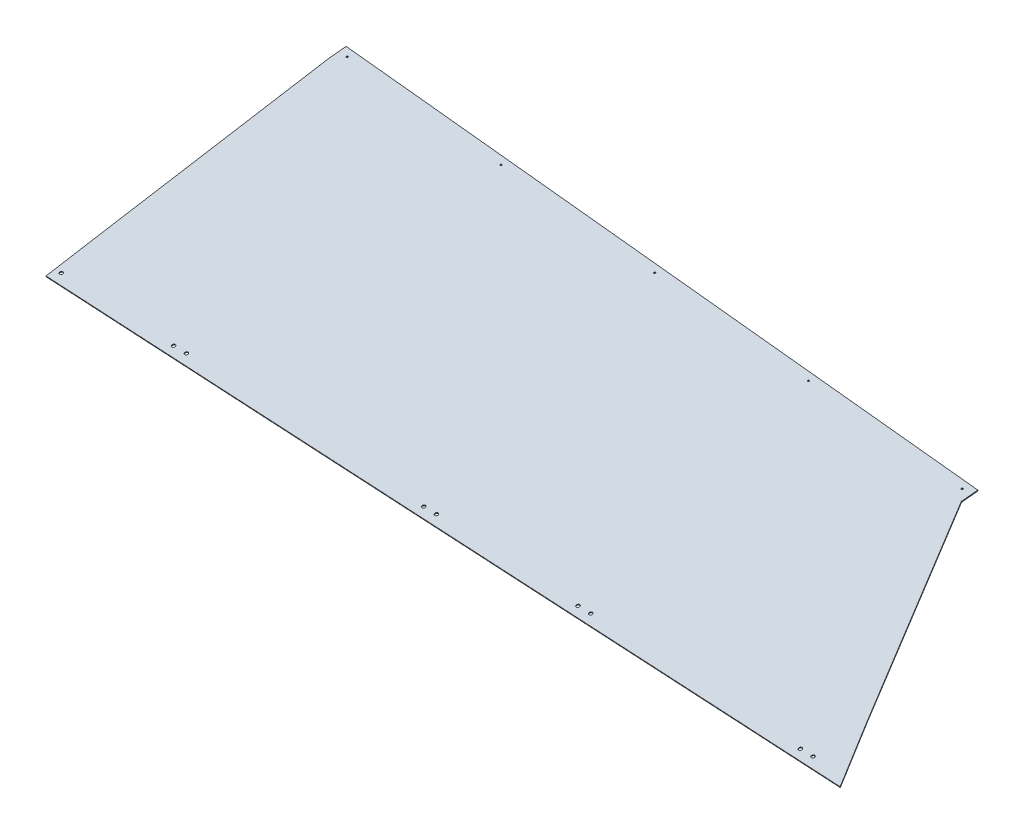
ISO-10303-21;
HEADER;
FILE_DESCRIPTION(('STEP AP214'),'2;1');
FILE_NAME('part.step','',(''),(''),'','','');
FILE_SCHEMA(('AUTOMOTIVE_DESIGN { 1 0 10303 214 1 1 1 1 }'));
ENDSEC;
DATA;
#1=APPLICATION_CONTEXT('core data for automotive mechanical design processes');
#2=APPLICATION_PROTOCOL_DEFINITION('international standard','automotive_design',2000,#1);
#3=PRODUCT_CONTEXT('',#1,'mechanical');
#4=PRODUCT('Part','Part','',(#3));
#5=PRODUCT_RELATED_PRODUCT_CATEGORY('part','',(#4));
#6=PRODUCT_DEFINITION_FORMATION('','',#4);
#7=PRODUCT_DEFINITION_CONTEXT('part definition',#1,'design');
#8=PRODUCT_DEFINITION('design','',#6,#7);
#9=PRODUCT_DEFINITION_SHAPE('','',#8);
#10=(LENGTH_UNIT() NAMED_UNIT(*) SI_UNIT(.MILLI.,.METRE.));
#11=(NAMED_UNIT(*) PLANE_ANGLE_UNIT() SI_UNIT($,.RADIAN.));
#12=(NAMED_UNIT(*) SI_UNIT($,.STERADIAN.) SOLID_ANGLE_UNIT());
#13=UNCERTAINTY_MEASURE_WITH_UNIT(LENGTH_MEASURE(1.E-05),#10,'distance_accuracy_value','');
#14=(GEOMETRIC_REPRESENTATION_CONTEXT(3) GLOBAL_UNCERTAINTY_ASSIGNED_CONTEXT((#13)) GLOBAL_UNIT_ASSIGNED_CONTEXT((#10,
#11,#12)) REPRESENTATION_CONTEXT('',''));
#15=CARTESIAN_POINT('',(0.,0.,0.));
#16=DIRECTION('',(0.,0.,1.));
#17=DIRECTION('',(1.,0.,0.));
#18=AXIS2_PLACEMENT_3D('',#15,#16,#17);
#19=CARTESIAN_POINT('',(6.04000777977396,-300.572395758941,-61.7927019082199));
#20=DIRECTION('',(-0.0196795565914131,0.979325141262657,0.201333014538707));
#21=DIRECTION('',(0.,-0.201372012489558,0.979514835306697));
#22=AXIS2_PLACEMENT_3D('',#19,#20,#21);
#23=PLANE('',#22);
#24=DIRECTION('',(0.0340234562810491,0.201911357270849,-0.978812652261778));
#25=VECTOR('',#24,1.);
#26=CARTESIAN_POINT('',(766.441701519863,-291.126569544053,-33.4126913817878));
#27=LINE('',#26,#25);
#28=CARTESIAN_POINT('',(793.777141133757,-128.905081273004,-819.819396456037));
#29=VERTEX_POINT('',#28);
#30=CARTESIAN_POINT('',(809.033287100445,-38.3678614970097,-1258.71980015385));
#31=VERTEX_POINT('',#30);
#32=EDGE_CURVE('E166',#29,#31,#27,.T.);
#33=ORIENTED_EDGE('',*,*,#32,.T.);
#34=DIRECTION('',(-0.0952713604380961,-0.202292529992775,0.974679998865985));
#35=VECTOR('',#34,1.);
#36=CARTESIAN_POINT('',(809.224725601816,-37.9613743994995,-1260.6783244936));
#37=LINE('',#36,#35);
#38=CARTESIAN_POINT('',(811.99728806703,-32.0743095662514,-1289.04320947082));
#39=VERTEX_POINT('',#38);
#40=EDGE_CURVE('E170',#39,#31,#37,.T.);
#41=ORIENTED_EDGE('',*,*,#40,.F.);
#42=DIRECTION('',(-0.995256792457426,0.,-0.0972826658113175));
#43=VECTOR('',#42,1.);
#44=CARTESIAN_POINT('',(-2549.86215064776,-32.0743095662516,-1617.65251991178));
#45=LINE('',#44,#43);
#46=CARTESIAN_POINT('',(2162.15614787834,-32.0743095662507,-1157.07018085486));
#47=VERTEX_POINT('',#46);
#48=EDGE_CURVE('E239',#47,#39,#45,.T.);
#49=ORIENTED_EDGE('',*,*,#48,.F.);
#50=DIRECTION('',(0.0952713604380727,0.202292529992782,-0.974679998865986));
#51=VECTOR('',#50,1.);
#52=CARTESIAN_POINT('',(2159.3182985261,-38.0999999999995,-1128.03737403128));
#53=LINE('',#52,#51);
#54=CARTESIAN_POINT('',(2159.3182985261,-38.0999999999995,-1128.03737403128));
#55=VERTEX_POINT('',#54);
#56=EDGE_CURVE('E191',#55,#47,#53,.T.);
#57=ORIENTED_EDGE('',*,*,#56,.F.);
#58=DIRECTION('',(0.458872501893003,-0.170063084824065,0.872074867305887));
#59=VECTOR('',#58,1.);
#60=CARTESIAN_POINT('',(2153.07848128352,-35.7874566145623,-1139.89597913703));
#61=LINE('',#60,#59);
#62=CARTESIAN_POINT('',(2362.95658734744,-113.570540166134,-741.028274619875));
#63=VERTEX_POINT('',#62);
#64=EDGE_CURVE('E176',#55,#63,#61,.T.);
#65=ORIENTED_EDGE('',*,*,#64,.T.);
#66=DIRECTION('',(-0.549500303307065,0.157636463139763,-0.820487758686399));
#67=VECTOR('',#66,1.);
#68=CARTESIAN_POINT('',(2363.38181094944,-113.692525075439,-740.393350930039));
#69=LINE('',#68,#67);
#70=CARTESIAN_POINT('',(2363.38181094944,-113.692525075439,-740.393350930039));
#71=VERTEX_POINT('',#70);
#72=EDGE_CURVE('E142',#71,#63,#69,.T.);
#73=ORIENTED_EDGE('',*,*,#72,.F.);
#74=DIRECTION('',(0.468027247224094,-0.168921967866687,0.867419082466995));
#75=VECTOR('',#74,1.);
#76=CARTESIAN_POINT('',(2157.84554695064,-39.5096855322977,-1121.32433003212));
#77=LINE('',#76,#75);
#78=CARTESIAN_POINT('',(2422.08735658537,-134.880728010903,-631.591329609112));
#79=VERTEX_POINT('',#78);
#80=EDGE_CURVE('E297',#71,#79,#77,.T.);
#81=ORIENTED_EDGE('',*,*,#80,.T.);
#82=DIRECTION('',(-0.998109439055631,-0.00751635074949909,-0.0610004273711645));
#83=VECTOR('',#82,1.);
#84=CARTESIAN_POINT('',(2449.4820662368,-134.674429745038,-629.917075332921));
#85=LINE('',#84,#83);
#86=CARTESIAN_POINT('',(790.947801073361,-147.164167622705,-731.28000711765));
#87=VERTEX_POINT('',#86);
#88=EDGE_CURVE('E304',#79,#87,#85,.T.);
#89=ORIENTED_EDGE('',*,*,#88,.T.);
#90=DIRECTION('',(0.0312390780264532,0.201875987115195,-0.978912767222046));
#91=VECTOR('',#90,1.);
#92=CARTESIAN_POINT('',(767.146224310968,-300.976863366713,14.5700257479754));
#93=LINE('',#92,#91);
#94=CARTESIAN_POINT('',(793.753728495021,-129.031450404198,-819.206999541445));
#95=VERTEX_POINT('',#94);
#96=EDGE_CURVE('E308',#87,#95,#93,.T.);
#97=ORIENTED_EDGE('',*,*,#96,.T.);
#98=DIRECTION('',(-0.0374160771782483,-0.201952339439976,0.978680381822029));
#99=VECTOR('',#98,1.);
#100=CARTESIAN_POINT('',(793.777141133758,-128.905081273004,-819.819396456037));
#101=LINE('',#100,#99);
#102=EDGE_CURVE('E175',#29,#95,#101,.T.);
#103=ORIENTED_EDGE('',*,*,#102,.F.);
#104=EDGE_LOOP('',(#33,#41,#49,#57,#65,#73,#81,#89,#97,#103));
#105=FACE_BOUND('',#104,.T.);
#106=CARTESIAN_POINT('',(827.96717309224,-34.6434246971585,-1274.98550859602));
#107=DIRECTION('',(0.0196795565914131,-0.979325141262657,-0.201333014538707));
#108=DIRECTION('',(-0.995256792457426,0.,-0.0972826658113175));
#109=AXIS2_PLACEMENT_3D('',#106,#107,#108);
#110=CIRCLE('',#109,1.58749999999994);
#111=CARTESIAN_POINT('',(826.387202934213,-34.6434246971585,-1275.139944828));
#112=VERTEX_POINT('',#111);
#113=EDGE_CURVE('E395',#112,#112,#110,.T.);
#114=ORIENTED_EDGE('',*,*,#113,.F.);
#115=EDGE_LOOP('',(#114));
#116=FACE_BOUND('',#115,.T.);
#117=CARTESIAN_POINT('',(1156.60096596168,-34.643424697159,-1242.86277234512));
#118=DIRECTION('',(0.0196795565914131,-0.979325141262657,-0.201333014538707));
#119=DIRECTION('',(-0.995256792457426,0.,-0.0972826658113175));
#120=AXIS2_PLACEMENT_3D('',#117,#118,#119);
#121=CIRCLE('',#120,1.58749999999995);
#122=CARTESIAN_POINT('',(1155.02099580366,-34.643424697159,-1243.0172085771));
#123=VERTEX_POINT('',#122);
#124=EDGE_CURVE('E398',#123,#123,#121,.T.);
#125=ORIENTED_EDGE('',*,*,#124,.F.);
#126=EDGE_LOOP('',(#125));
#127=FACE_BOUND('',#126,.T.);
#128=CARTESIAN_POINT('',(1485.23475883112,-34.6434246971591,-1210.74003609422));
#129=DIRECTION('',(0.0196795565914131,-0.979325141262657,-0.201333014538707));
#130=DIRECTION('',(-0.995256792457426,0.,-0.0972826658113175));
#131=AXIS2_PLACEMENT_3D('',#128,#129,#130);
#132=CIRCLE('',#131,1.58749999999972);
#133=CARTESIAN_POINT('',(1483.6547886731,-34.6434246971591,-1210.8944723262));
#134=VERTEX_POINT('',#133);
#135=EDGE_CURVE('E401',#134,#134,#132,.T.);
#136=ORIENTED_EDGE('',*,*,#135,.F.);
#137=EDGE_LOOP('',(#136));
#138=FACE_BOUND('',#137,.T.);
#139=CARTESIAN_POINT('',(1813.86855170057,-34.6434246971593,-1178.61729984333));
#140=DIRECTION('',(0.0196795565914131,-0.979325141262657,-0.201333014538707));
#141=DIRECTION('',(-0.995256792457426,0.,-0.0972826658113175));
#142=AXIS2_PLACEMENT_3D('',#139,#140,#141);
#143=CIRCLE('',#142,1.58749999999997);
#144=CARTESIAN_POINT('',(1812.28858154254,-34.6434246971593,-1178.7717360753));
#145=VERTEX_POINT('',#144);
#146=EDGE_CURVE('E404',#145,#145,#143,.T.);
#147=ORIENTED_EDGE('',*,*,#146,.F.);
#148=EDGE_LOOP('',(#147));
#149=FACE_BOUND('',#148,.T.);
#150=CARTESIAN_POINT('',(2142.50234457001,-34.6434246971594,-1146.49456359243));
#151=DIRECTION('',(0.0196795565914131,-0.979325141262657,-0.201333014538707));
#152=DIRECTION('',(-0.995256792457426,0.,-0.0972826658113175));
#153=AXIS2_PLACEMENT_3D('',#150,#151,#152);
#154=CIRCLE('',#153,1.58750000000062);
#155=CARTESIAN_POINT('',(2140.92237441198,-34.6434246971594,-1146.6489998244));
#156=VERTEX_POINT('',#155);
#157=EDGE_CURVE('E246',#156,#156,#154,.T.);
#158=ORIENTED_EDGE('',*,*,#157,.F.);
#159=EDGE_LOOP('',(#158));
#160=FACE_BOUND('',#159,.T.);
#161=CARTESIAN_POINT('',(804.318580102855,-143.551091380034,-747.547808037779));
#162=DIRECTION('',(0.0196795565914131,-0.979325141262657,-0.201333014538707));
#163=DIRECTION('',(-0.00344658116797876,0.201304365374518,-0.979522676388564));
#164=AXIS2_PLACEMENT_3D('',#161,#162,#163);
#165=CIRCLE('',#164,3.17500000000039);
#166=CARTESIAN_POINT('',(804.307637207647,-142.91195001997,-750.657792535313));
#167=VERTEX_POINT('',#166);
#168=EDGE_CURVE('E324',#167,#167,#165,.T.);
#169=ORIENTED_EDGE('',*,*,#168,.F.);
#170=EDGE_LOOP('',(#169));
#171=FACE_BOUND('',#170,.T.);
#172=CARTESIAN_POINT('',(1035.72668025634,-141.960151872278,-732.667179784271));
#173=DIRECTION('',(0.0196795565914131,-0.979325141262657,-0.201333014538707));
#174=DIRECTION('',(-0.00344658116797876,0.201304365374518,-0.979522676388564));
#175=AXIS2_PLACEMENT_3D('',#172,#173,#174);
#176=CIRCLE('',#175,3.17500000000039);
#177=CARTESIAN_POINT('',(1035.71573736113,-141.321010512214,-735.777164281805));
#178=VERTEX_POINT('',#177);
#179=EDGE_CURVE('E330',#178,#178,#176,.T.);
#180=ORIENTED_EDGE('',*,*,#179,.F.);
#181=EDGE_LOOP('',(#180));
#182=FACE_BOUND('',#181,.T.);
#183=CARTESIAN_POINT('',(1061.11133359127,-141.617294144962,-731.853654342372));
#184=DIRECTION('',(0.0196795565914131,-0.979325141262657,-0.201333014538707));
#185=DIRECTION('',(-0.00344658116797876,0.201304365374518,-0.979522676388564));
#186=AXIS2_PLACEMENT_3D('',#183,#184,#185);
#187=CIRCLE('',#186,3.17500000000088);
#188=CARTESIAN_POINT('',(1061.10039069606,-140.978152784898,-734.963638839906));
#189=VERTEX_POINT('',#188);
#190=EDGE_CURVE('E336',#189,#189,#187,.T.);
#191=ORIENTED_EDGE('',*,*,#190,.F.);
#192=EDGE_LOOP('',(#191));
#193=FACE_BOUND('',#192,.T.);
#194=CARTESIAN_POINT('',(1549.31218723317,-138.092557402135,-701.278872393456));
#195=DIRECTION('',(0.0196795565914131,-0.979325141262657,-0.201333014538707));
#196=DIRECTION('',(-0.00344658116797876,0.201304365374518,-0.979522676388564));
#197=AXIS2_PLACEMENT_3D('',#194,#195,#196);
#198=CIRCLE('',#197,3.17500000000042);
#199=CARTESIAN_POINT('',(1549.30124433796,-137.453416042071,-704.38885689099));
#200=VERTEX_POINT('',#199);
#201=EDGE_CURVE('E342',#200,#200,#198,.T.);
#202=ORIENTED_EDGE('',*,*,#201,.F.);
#203=EDGE_LOOP('',(#202));
#204=FACE_BOUND('',#203,.T.);
#205=CARTESIAN_POINT('',(1574.69684056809,-137.749699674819,-700.465346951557));
#206=DIRECTION('',(0.0196795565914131,-0.979325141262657,-0.201333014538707));
#207=DIRECTION('',(-0.00344658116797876,0.201304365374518,-0.979522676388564));
#208=AXIS2_PLACEMENT_3D('',#205,#206,#207);
#209=CIRCLE('',#208,3.17500000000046);
#210=CARTESIAN_POINT('',(1574.68589767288,-137.110558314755,-703.575331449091));
#211=VERTEX_POINT('',#210);
#212=EDGE_CURVE('E348',#211,#211,#209,.T.);
#213=ORIENTED_EDGE('',*,*,#212,.F.);
#214=EDGE_LOOP('',(#213));
#215=FACE_BOUND('',#214,.T.);
#216=CARTESIAN_POINT('',(1866.3402779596,-135.705153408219,-681.903374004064));
#217=DIRECTION('',(0.0196795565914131,-0.979325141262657,-0.201333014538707));
#218=DIRECTION('',(-0.00344658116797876,0.201304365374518,-0.979522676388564));
#219=AXIS2_PLACEMENT_3D('',#216,#217,#218);
#220=CIRCLE('',#219,3.17500000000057);
#221=CARTESIAN_POINT('',(1866.32933506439,-135.066012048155,-685.013358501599));
#222=VERTEX_POINT('',#221);
#223=EDGE_CURVE('E354',#222,#222,#220,.T.);
#224=ORIENTED_EDGE('',*,*,#223,.F.);
#225=EDGE_LOOP('',(#224));
#226=FACE_BOUND('',#225,.T.);
#227=CARTESIAN_POINT('',(1891.72493129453,-135.362295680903,-681.089848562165));
#228=DIRECTION('',(0.0196795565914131,-0.979325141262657,-0.201333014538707));
#229=DIRECTION('',(-0.00344658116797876,0.201304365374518,-0.979522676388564));
#230=AXIS2_PLACEMENT_3D('',#227,#228,#229);
#231=CIRCLE('',#230,3.17500000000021);
#232=CARTESIAN_POINT('',(1891.71398839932,-134.723154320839,-684.199833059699));
#233=VERTEX_POINT('',#232);
#234=EDGE_CURVE('E360',#233,#233,#231,.T.);
#235=ORIENTED_EDGE('',*,*,#234,.F.);
#236=EDGE_LOOP('',(#235));
#237=FACE_BOUND('',#236,.T.);
#238=CARTESIAN_POINT('',(2322.86072860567,-132.267291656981,-654.00265632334));
#239=DIRECTION('',(0.0196795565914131,-0.979325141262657,-0.201333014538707));
#240=DIRECTION('',(-0.00344658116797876,0.201304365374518,-0.979522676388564));
#241=AXIS2_PLACEMENT_3D('',#238,#239,#240);
#242=CIRCLE('',#241,3.1750000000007);
#243=CARTESIAN_POINT('',(2322.84978571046,-131.628150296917,-657.112640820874));
#244=VERTEX_POINT('',#243);
#245=EDGE_CURVE('E366',#244,#244,#242,.T.);
#246=ORIENTED_EDGE('',*,*,#245,.F.);
#247=EDGE_LOOP('',(#246));
#248=FACE_BOUND('',#247,.T.);
#249=CARTESIAN_POINT('',(2348.24538194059,-131.924433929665,-653.189130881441));
#250=DIRECTION('',(0.0196795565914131,-0.979325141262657,-0.201333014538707));
#251=DIRECTION('',(-0.00344658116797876,0.201304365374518,-0.979522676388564));
#252=AXIS2_PLACEMENT_3D('',#249,#250,#251);
#253=CIRCLE('',#252,3.17500000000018);
#254=CARTESIAN_POINT('',(2348.23443904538,-131.285292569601,-656.299115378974));
#255=VERTEX_POINT('',#254);
#256=EDGE_CURVE('E372',#255,#255,#253,.T.);
#257=ORIENTED_EDGE('',*,*,#256,.F.);
#258=EDGE_LOOP('',(#257));
#259=FACE_BOUND('',#258,.T.);
#260=ADVANCED_FACE('F127',(#105,#116,#127,#138,#149,#160,#171,#182,#193,#204,#215,#226,#237,
#248,#259),#23,.F.);
#261=CARTESIAN_POINT('',(2087.92964251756,3206.25183584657,-473.386444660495));
#262=DIRECTION('',(0.888284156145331,0.109548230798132,-0.446038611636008));
#263=DIRECTION('',(-0.448739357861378,0.,-0.893662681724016));
#264=AXIS2_PLACEMENT_3D('',#261,#262,#263);
#265=PLANE('',#264);
#266=ORIENTED_EDGE('',*,*,#64,.F.);
#267=DIRECTION('',(-0.0196795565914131,0.979325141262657,0.201333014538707));
#268=VECTOR('',#267,1.);
#269=CARTESIAN_POINT('',(2159.3023029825,-37.3040045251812,-1127.87373055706));
#270=LINE('',#269,#268);
#271=CARTESIAN_POINT('',(2159.28630743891,-36.508009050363,-1127.71008708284));
#272=VERTEX_POINT('',#271);
#273=EDGE_CURVE('E183',#55,#272,#270,.T.);
#274=ORIENTED_EDGE('',*,*,#273,.T.);
#275=DIRECTION('',(0.458872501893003,-0.170063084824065,0.872074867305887));
#276=VECTOR('',#275,1.);
#277=CARTESIAN_POINT('',(2153.04649019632,-34.1954656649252,-1139.56869218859));
#278=LINE('',#277,#276);
#279=CARTESIAN_POINT('',(2362.92459626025,-111.978549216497,-740.700987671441));
#280=VERTEX_POINT('',#279);
#281=EDGE_CURVE('E202',#272,#280,#278,.T.);
#282=ORIENTED_EDGE('',*,*,#281,.T.);
#283=DIRECTION('',(-0.0196795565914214,0.97932514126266,0.201333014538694));
#284=VECTOR('',#283,1.);
#285=CARTESIAN_POINT('',(2362.94059180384,-112.774544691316,-740.864631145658));
#286=LINE('',#285,#284);
#287=EDGE_CURVE('E13',#63,#280,#286,.T.);
#288=ORIENTED_EDGE('',*,*,#287,.F.);
#289=EDGE_LOOP('',(#266,#274,#282,#288));
#290=FACE_BOUND('',#289,.T.);
#291=ADVANCED_FACE('F223',(#290),#265,.T.);
#292=CARTESIAN_POINT('',(701.292862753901,2950.91272291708,633.096843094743));
#293=DIRECTION('',(-0.999227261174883,-0.0124125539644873,-0.037293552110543));
#294=DIRECTION('',(-0.0372964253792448,0.,0.999304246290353));
#295=AXIS2_PLACEMENT_3D('',#292,#293,#294);
#296=PLANE('',#295);
#297=ORIENTED_EDGE('',*,*,#32,.F.);
#298=CARTESIAN_POINT('',(793.777141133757,-128.905081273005,-819.819396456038));
#299=DIRECTION('',(-0.0196795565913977,0.979325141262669,0.201333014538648));
#300=VECTOR('',#299,1.);
#301=LINE('',#298,#300);
#302=CARTESIAN_POINT('',(793.745150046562,-127.313090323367,-819.492109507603));
#303=VERTEX_POINT('',#302);
#304=EDGE_CURVE('E136',#29,#303,#301,.T.);
#305=ORIENTED_EDGE('',*,*,#304,.T.);
#306=DIRECTION('',(0.0340234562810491,0.201911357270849,-0.978812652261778));
#307=VECTOR('',#306,1.);
#308=CARTESIAN_POINT('',(766.409710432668,-289.534578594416,-33.0854044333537));
#309=LINE('',#308,#307);
#310=CARTESIAN_POINT('',(809.001296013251,-36.7758705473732,-1258.39251320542));
#311=VERTEX_POINT('',#310);
#312=EDGE_CURVE('E151',#303,#311,#309,.T.);
#313=ORIENTED_EDGE('',*,*,#312,.T.);
#314=DIRECTION('',(-0.0196795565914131,0.979325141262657,0.201333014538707));
#315=VECTOR('',#314,1.);
#316=CARTESIAN_POINT('',(809.017291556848,-37.5718660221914,-1258.55615667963));
#317=LINE('',#316,#315);
#318=EDGE_CURVE('E178',#31,#311,#317,.T.);
#319=ORIENTED_EDGE('',*,*,#318,.F.);
#320=EDGE_LOOP('',(#297,#305,#313,#319));
#321=FACE_BOUND('',#320,.T.);
#322=ADVANCED_FACE('F179',(#321),#296,.T.);
#323=CARTESIAN_POINT('',(6.00801669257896,-298.980404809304,-61.4654149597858));
#324=DIRECTION('',(-0.0196795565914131,0.979325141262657,0.201333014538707));
#325=DIRECTION('',(0.,-0.201372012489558,0.979514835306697));
#326=AXIS2_PLACEMENT_3D('',#323,#324,#325);
#327=PLANE('',#326);
#328=ORIENTED_EDGE('',*,*,#281,.F.);
#329=DIRECTION('',(0.0952713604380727,0.202292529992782,-0.974679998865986));
#330=VECTOR('',#329,1.);
#331=CARTESIAN_POINT('',(2159.2863074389,-36.5080090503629,-1127.71008708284));
#332=LINE('',#331,#330);
#333=CARTESIAN_POINT('',(2162.12415679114,-30.4823186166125,-1156.74289390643));
#334=VERTEX_POINT('',#333);
#335=EDGE_CURVE('E190',#272,#334,#332,.T.);
#336=ORIENTED_EDGE('',*,*,#335,.T.);
#337=DIRECTION('',(-0.995256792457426,0.,-0.0972826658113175));
#338=VECTOR('',#337,1.);
#339=CARTESIAN_POINT('',(132.459438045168,-30.4823186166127,-1355.13510387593));
#340=LINE('',#339,#338);
#341=CARTESIAN_POINT('',(811.965296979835,-30.4823186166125,-1288.71592252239));
#342=VERTEX_POINT('',#341);
#343=EDGE_CURVE('E257',#334,#342,#340,.T.);
#344=ORIENTED_EDGE('',*,*,#343,.T.);
#345=DIRECTION('',(-0.0952713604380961,-0.202292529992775,0.974679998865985));
#346=VECTOR('',#345,1.);
#347=CARTESIAN_POINT('',(809.192734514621,-36.369383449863,-1260.35103754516));
#348=LINE('',#347,#346);
#349=EDGE_CURVE('E184',#342,#311,#348,.T.);
#350=ORIENTED_EDGE('',*,*,#349,.T.);
#351=ORIENTED_EDGE('',*,*,#312,.F.);
#352=DIRECTION('',(-0.0374160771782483,-0.201952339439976,0.978680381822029));
#353=VECTOR('',#352,1.);
#354=CARTESIAN_POINT('',(793.745150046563,-127.313090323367,-819.492109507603));
#355=LINE('',#354,#353);
#356=CARTESIAN_POINT('',(793.721737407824,-127.439459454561,-818.879712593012));
#357=VERTEX_POINT('',#356);
#358=EDGE_CURVE('E249',#303,#357,#355,.T.);
#359=ORIENTED_EDGE('',*,*,#358,.T.);
#360=DIRECTION('',(0.0312390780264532,0.201875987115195,-0.978912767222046));
#361=VECTOR('',#360,1.);
#362=CARTESIAN_POINT('',(767.114233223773,-299.384872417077,14.8973126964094));
#363=LINE('',#362,#361);
#364=CARTESIAN_POINT('',(790.915809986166,-145.572176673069,-730.952720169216));
#365=VERTEX_POINT('',#364);
#366=EDGE_CURVE('E317',#365,#357,#363,.T.);
#367=ORIENTED_EDGE('',*,*,#366,.F.);
#368=DIRECTION('',(-0.998109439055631,-0.00751635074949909,-0.0610004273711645));
#369=VECTOR('',#368,1.);
#370=CARTESIAN_POINT('',(2449.4500751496,-133.082438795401,-629.589788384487));
#371=LINE('',#370,#369);
#372=CARTESIAN_POINT('',(2422.05536549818,-133.288737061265,-631.264042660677));
#373=VERTEX_POINT('',#372);
#374=EDGE_CURVE('E322',#373,#365,#371,.T.);
#375=ORIENTED_EDGE('',*,*,#374,.F.);
#376=DIRECTION('',(0.468027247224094,-0.168921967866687,0.867419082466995));
#377=VECTOR('',#376,1.);
#378=CARTESIAN_POINT('',(2157.81355586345,-37.9176945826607,-1120.99704308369));
#379=LINE('',#378,#377);
#380=CARTESIAN_POINT('',(2363.34981986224,-112.100534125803,-740.066063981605));
#381=VERTEX_POINT('',#380);
#382=EDGE_CURVE('E298',#381,#373,#379,.T.);
#383=ORIENTED_EDGE('',*,*,#382,.F.);
#384=DIRECTION('',(-0.549500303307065,0.157636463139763,-0.820487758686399));
#385=VECTOR('',#384,1.);
#386=CARTESIAN_POINT('',(2363.34981986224,-112.100534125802,-740.066063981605));
#387=LINE('',#386,#385);
#388=EDGE_CURVE('E244',#381,#280,#387,.T.);
#389=ORIENTED_EDGE('',*,*,#388,.T.);
#390=EDGE_LOOP('',(#328,#336,#344,#350,#351,#359,#367,#375,#383,#389));
#391=FACE_BOUND('',#390,.T.);
#392=CARTESIAN_POINT('',(827.935182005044,-33.0514337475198,-1274.65822164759));
#393=DIRECTION('',(0.0196795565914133,-0.979325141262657,-0.201333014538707));
#394=DIRECTION('',(-0.995256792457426,0.,-0.0972826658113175));
#395=AXIS2_PLACEMENT_3D('',#392,#393,#394);
#396=CIRCLE('',#395,1.58749999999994);
#397=CARTESIAN_POINT('',(826.355211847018,-33.0514337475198,-1274.81265787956));
#398=VERTEX_POINT('',#397);
#399=EDGE_CURVE('E392',#398,#398,#396,.T.);
#400=ORIENTED_EDGE('',*,*,#399,.T.);
#401=EDGE_LOOP('',(#400));
#402=FACE_BOUND('',#401,.T.);
#403=CARTESIAN_POINT('',(1156.56897487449,-33.0514337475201,-1242.53548539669));
#404=DIRECTION('',(0.0196795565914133,-0.979325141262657,-0.201333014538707));
#405=DIRECTION('',(-0.995256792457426,0.,-0.0972826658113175));
#406=AXIS2_PLACEMENT_3D('',#403,#404,#405);
#407=CIRCLE('',#406,1.58749999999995);
#408=CARTESIAN_POINT('',(1154.98900471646,-33.0514337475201,-1242.68992162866));
#409=VERTEX_POINT('',#408);
#410=EDGE_CURVE('E389',#409,#409,#407,.T.);
#411=ORIENTED_EDGE('',*,*,#410,.T.);
#412=EDGE_LOOP('',(#411));
#413=FACE_BOUND('',#412,.T.);
#414=CARTESIAN_POINT('',(1485.20276774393,-33.0514337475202,-1210.41274914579));
#415=DIRECTION('',(0.0196795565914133,-0.979325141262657,-0.201333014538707));
#416=DIRECTION('',(-0.995256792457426,0.,-0.0972826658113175));
#417=AXIS2_PLACEMENT_3D('',#414,#415,#416);
#418=CIRCLE('',#417,1.58749999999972);
#419=CARTESIAN_POINT('',(1483.6227975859,-33.0514337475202,-1210.56718537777));
#420=VERTEX_POINT('',#419);
#421=EDGE_CURVE('E386',#420,#420,#418,.T.);
#422=ORIENTED_EDGE('',*,*,#421,.T.);
#423=EDGE_LOOP('',(#422));
#424=FACE_BOUND('',#423,.T.);
#425=CARTESIAN_POINT('',(1813.83656061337,-33.0514337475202,-1178.29001289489));
#426=DIRECTION('',(0.0196795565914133,-0.979325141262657,-0.201333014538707));
#427=DIRECTION('',(-0.995256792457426,0.,-0.0972826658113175));
#428=AXIS2_PLACEMENT_3D('',#425,#426,#427);
#429=CIRCLE('',#428,1.58749999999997);
#430=CARTESIAN_POINT('',(1812.25659045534,-33.0514337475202,-1178.44444912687));
#431=VERTEX_POINT('',#430);
#432=EDGE_CURVE('E383',#431,#431,#429,.T.);
#433=ORIENTED_EDGE('',*,*,#432,.T.);
#434=EDGE_LOOP('',(#433));
#435=FACE_BOUND('',#434,.T.);
#436=CARTESIAN_POINT('',(2142.47035348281,-33.0514337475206,-1146.16727664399));
#437=DIRECTION('',(0.0196795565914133,-0.979325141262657,-0.201333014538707));
#438=DIRECTION('',(-0.995256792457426,0.,-0.0972826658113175));
#439=AXIS2_PLACEMENT_3D('',#436,#437,#438);
#440=CIRCLE('',#439,1.58750000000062);
#441=CARTESIAN_POINT('',(2140.89038332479,-33.0514337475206,-1146.32171287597));
#442=VERTEX_POINT('',#441);
#443=EDGE_CURVE('E380',#442,#442,#440,.T.);
#444=ORIENTED_EDGE('',*,*,#443,.T.);
#445=EDGE_LOOP('',(#444));
#446=FACE_BOUND('',#445,.T.);
#447=CARTESIAN_POINT('',(804.28658901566,-141.959100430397,-747.220521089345));
#448=DIRECTION('',(-0.0196795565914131,0.979325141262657,0.201333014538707));
#449=DIRECTION('',(0.00344658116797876,-0.201304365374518,0.979522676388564));
#450=AXIS2_PLACEMENT_3D('',#447,#448,#449);
#451=CIRCLE('',#450,3.17500000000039);
#452=CARTESIAN_POINT('',(804.297531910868,-142.598241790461,-744.110536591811));
#453=VERTEX_POINT('',#452);
#454=EDGE_CURVE('E327',#453,#453,#451,.T.);
#455=ORIENTED_EDGE('',*,*,#454,.F.);
#456=EDGE_LOOP('',(#455));
#457=FACE_BOUND('',#456,.T.);
#458=CARTESIAN_POINT('',(1035.69468916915,-140.368160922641,-732.339892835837));
#459=DIRECTION('',(-0.0196795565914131,0.979325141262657,0.201333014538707));
#460=DIRECTION('',(0.00344658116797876,-0.201304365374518,0.979522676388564));
#461=AXIS2_PLACEMENT_3D('',#458,#459,#460);
#462=CIRCLE('',#461,3.17500000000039);
#463=CARTESIAN_POINT('',(1035.70563206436,-141.007302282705,-729.229908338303));
#464=VERTEX_POINT('',#463);
#465=EDGE_CURVE('E333',#464,#464,#462,.T.);
#466=ORIENTED_EDGE('',*,*,#465,.F.);
#467=EDGE_LOOP('',(#466));
#468=FACE_BOUND('',#467,.T.);
#469=CARTESIAN_POINT('',(1061.07934250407,-140.025303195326,-731.526367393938));
#470=DIRECTION('',(-0.0196795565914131,0.979325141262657,0.201333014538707));
#471=DIRECTION('',(0.00344658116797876,-0.201304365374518,0.979522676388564));
#472=AXIS2_PLACEMENT_3D('',#469,#470,#471);
#473=CIRCLE('',#472,3.17500000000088);
#474=CARTESIAN_POINT('',(1061.09028539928,-140.66444455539,-728.416382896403));
#475=VERTEX_POINT('',#474);
#476=EDGE_CURVE('E339',#475,#475,#473,.T.);
#477=ORIENTED_EDGE('',*,*,#476,.F.);
#478=EDGE_LOOP('',(#477));
#479=FACE_BOUND('',#478,.T.);
#480=CARTESIAN_POINT('',(1549.28019614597,-136.500566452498,-700.951585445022));
#481=DIRECTION('',(-0.0196795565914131,0.979325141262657,0.201333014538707));
#482=DIRECTION('',(0.00344658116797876,-0.201304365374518,0.979522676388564));
#483=AXIS2_PLACEMENT_3D('',#480,#481,#482);
#484=CIRCLE('',#483,3.17500000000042);
#485=CARTESIAN_POINT('',(1549.29113904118,-137.139707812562,-697.841600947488));
#486=VERTEX_POINT('',#485);
#487=EDGE_CURVE('E345',#486,#486,#484,.T.);
#488=ORIENTED_EDGE('',*,*,#487,.F.);
#489=EDGE_LOOP('',(#488));
#490=FACE_BOUND('',#489,.T.);
#491=CARTESIAN_POINT('',(1574.6648494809,-136.157708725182,-700.138060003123));
#492=DIRECTION('',(-0.0196795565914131,0.979325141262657,0.201333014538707));
#493=DIRECTION('',(0.00344658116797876,-0.201304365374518,0.979522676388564));
#494=AXIS2_PLACEMENT_3D('',#491,#492,#493);
#495=CIRCLE('',#494,3.17500000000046);
#496=CARTESIAN_POINT('',(1574.6757923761,-136.796850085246,-697.028075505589));
#497=VERTEX_POINT('',#496);
#498=EDGE_CURVE('E351',#497,#497,#495,.T.);
#499=ORIENTED_EDGE('',*,*,#498,.F.);
#500=EDGE_LOOP('',(#499));
#501=FACE_BOUND('',#500,.T.);
#502=CARTESIAN_POINT('',(1866.30828687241,-134.113162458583,-681.57608705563));
#503=DIRECTION('',(-0.0196795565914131,0.979325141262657,0.201333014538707));
#504=DIRECTION('',(0.00344658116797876,-0.201304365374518,0.979522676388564));
#505=AXIS2_PLACEMENT_3D('',#502,#503,#504);
#506=CIRCLE('',#505,3.17500000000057);
#507=CARTESIAN_POINT('',(1866.31922976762,-134.752303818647,-678.466102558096));
#508=VERTEX_POINT('',#507);
#509=EDGE_CURVE('E357',#508,#508,#506,.T.);
#510=ORIENTED_EDGE('',*,*,#509,.F.);
#511=EDGE_LOOP('',(#510));
#512=FACE_BOUND('',#511,.T.);
#513=CARTESIAN_POINT('',(1891.69294020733,-133.770304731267,-680.762561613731));
#514=DIRECTION('',(-0.0196795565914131,0.979325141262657,0.201333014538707));
#515=DIRECTION('',(0.00344658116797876,-0.201304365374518,0.979522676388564));
#516=AXIS2_PLACEMENT_3D('',#513,#514,#515);
#517=CIRCLE('',#516,3.17500000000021);
#518=CARTESIAN_POINT('',(1891.70388310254,-134.409446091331,-677.652577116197));
#519=VERTEX_POINT('',#518);
#520=EDGE_CURVE('E363',#519,#519,#517,.T.);
#521=ORIENTED_EDGE('',*,*,#520,.F.);
#522=EDGE_LOOP('',(#521));
#523=FACE_BOUND('',#522,.T.);
#524=CARTESIAN_POINT('',(2322.82873751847,-130.675300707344,-653.675369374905));
#525=DIRECTION('',(-0.0196795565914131,0.979325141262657,0.201333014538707));
#526=DIRECTION('',(0.00344658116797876,-0.201304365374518,0.979522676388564));
#527=AXIS2_PLACEMENT_3D('',#524,#525,#526);
#528=CIRCLE('',#527,3.1750000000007);
#529=CARTESIAN_POINT('',(2322.83968041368,-131.314442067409,-650.565384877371));
#530=VERTEX_POINT('',#529);
#531=EDGE_CURVE('E369',#530,#530,#528,.T.);
#532=ORIENTED_EDGE('',*,*,#531,.F.);
#533=EDGE_LOOP('',(#532));
#534=FACE_BOUND('',#533,.T.);
#535=CARTESIAN_POINT('',(2348.2133908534,-130.332442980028,-652.861843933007));
#536=DIRECTION('',(-0.0196795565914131,0.979325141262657,0.201333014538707));
#537=DIRECTION('',(0.00344658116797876,-0.201304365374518,0.979522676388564));
#538=AXIS2_PLACEMENT_3D('',#535,#536,#537);
#539=CIRCLE('',#538,3.17500000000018);
#540=CARTESIAN_POINT('',(2348.22433374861,-130.971584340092,-649.751859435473));
#541=VERTEX_POINT('',#540);
#542=EDGE_CURVE('E375',#541,#541,#539,.T.);
#543=ORIENTED_EDGE('',*,*,#542,.F.);
#544=EDGE_LOOP('',(#543));
#545=FACE_BOUND('',#544,.T.);
#546=ADVANCED_FACE('F129',(#391,#402,#413,#424,#435,#446,#457,#468,#479,#490,#501,#512,#523,
#534,#545),#327,.T.);
#547=CARTESIAN_POINT('',(2159.3023029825,-37.3040045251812,-1127.87373055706));
#548=DIRECTION('',(0.995256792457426,0.,0.0972826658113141));
#549=DIRECTION('',(0.0952713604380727,0.202292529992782,-0.974679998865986));
#550=AXIS2_PLACEMENT_3D('',#547,#548,#549);
#551=PLANE('',#550);
#552=ORIENTED_EDGE('',*,*,#273,.F.);
#553=ORIENTED_EDGE('',*,*,#56,.T.);
#554=DIRECTION('',(0.0196795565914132,-0.979325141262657,-0.201333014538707));
#555=VECTOR('',#554,1.);
#556=CARTESIAN_POINT('',(2108.50083041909,2638.00624363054,-608.145881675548));
#557=LINE('',#556,#555);
#558=EDGE_CURVE('E243',#334,#47,#557,.T.);
#559=ORIENTED_EDGE('',*,*,#558,.F.);
#560=ORIENTED_EDGE('',*,*,#335,.F.);
#561=EDGE_LOOP('',(#552,#553,#559,#560));
#562=FACE_BOUND('',#561,.T.);
#563=ADVANCED_FACE('F235',(#562),#551,.T.);
#564=CARTESIAN_POINT('',(809.208730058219,-37.1653789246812,-1260.51468101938));
#565=DIRECTION('',(-0.995256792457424,0.,-0.0972826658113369));
#566=DIRECTION('',(-0.0952713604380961,-0.202292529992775,0.974679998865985));
#567=AXIS2_PLACEMENT_3D('',#564,#565,#566);
#568=PLANE('',#567);
#569=ORIENTED_EDGE('',*,*,#349,.F.);
#570=DIRECTION('',(0.0196795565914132,-0.979325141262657,-0.201333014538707));
#571=VECTOR('',#570,1.);
#572=CARTESIAN_POINT('',(758.341970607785,2638.00624363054,-740.118910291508));
#573=LINE('',#572,#571);
#574=EDGE_CURVE('E188',#342,#39,#573,.T.);
#575=ORIENTED_EDGE('',*,*,#574,.T.);
#576=ORIENTED_EDGE('',*,*,#40,.T.);
#577=ORIENTED_EDGE('',*,*,#318,.T.);
#578=EDGE_LOOP('',(#569,#575,#576,#577));
#579=FACE_BOUND('',#578,.T.);
#580=ADVANCED_FACE('F186',(#579),#568,.T.);
#581=CARTESIAN_POINT('',(78.8361116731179,2638.00624363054,-806.538091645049));
#582=DIRECTION('',(-0.0952713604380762,-0.202292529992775,0.974679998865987));
#583=DIRECTION('',(0.,-0.979133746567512,-0.203216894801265));
#584=AXIS2_PLACEMENT_3D('',#581,#582,#583);
#585=PLANE('',#584);
#586=ORIENTED_EDGE('',*,*,#48,.T.);
#587=ORIENTED_EDGE('',*,*,#574,.F.);
#588=ORIENTED_EDGE('',*,*,#343,.F.);
#589=ORIENTED_EDGE('',*,*,#558,.T.);
#590=EDGE_LOOP('',(#586,#587,#588,#589));
#591=FACE_BOUND('',#590,.T.);
#592=ADVANCED_FACE('F516',(#591),#585,.F.);
#593=CARTESIAN_POINT('',(2142.45235849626,-32.1559388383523,-1145.9831777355));
#594=DIRECTION('',(0.0196795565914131,-0.979325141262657,-0.201333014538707));
#595=DIRECTION('',(-0.995256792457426,0.,-0.0972826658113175));
#596=AXIS2_PLACEMENT_3D('',#593,#594,#595);
#597=CYLINDRICAL_SURFACE('',#596,1.58750000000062);
#598=ORIENTED_EDGE('',*,*,#157,.T.);
#599=EDGE_LOOP('',(#598));
#600=FACE_BOUND('',#599,.T.);
#601=ORIENTED_EDGE('',*,*,#443,.F.);
#602=EDGE_LOOP('',(#601));
#603=FACE_BOUND('',#602,.T.);
#604=ADVANCED_FACE('F409',(#600,#603),#597,.F.);
#605=CARTESIAN_POINT('',(1813.81856562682,-32.1559388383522,-1178.1059139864));
#606=DIRECTION('',(0.0196795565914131,-0.979325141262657,-0.201333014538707));
#607=DIRECTION('',(-0.995256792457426,0.,-0.0972826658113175));
#608=AXIS2_PLACEMENT_3D('',#605,#606,#607);
#609=CYLINDRICAL_SURFACE('',#608,1.58749999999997);
#610=ORIENTED_EDGE('',*,*,#146,.T.);
#611=EDGE_LOOP('',(#610));
#612=FACE_BOUND('',#611,.T.);
#613=ORIENTED_EDGE('',*,*,#432,.F.);
#614=EDGE_LOOP('',(#613));
#615=FACE_BOUND('',#614,.T.);
#616=ADVANCED_FACE('F521',(#612,#615),#609,.F.);
#617=CARTESIAN_POINT('',(1485.18477275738,-32.155938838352,-1210.2286502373));
#618=DIRECTION('',(0.0196795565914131,-0.979325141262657,-0.201333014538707));
#619=DIRECTION('',(-0.995256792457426,0.,-0.0972826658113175));
#620=AXIS2_PLACEMENT_3D('',#617,#618,#619);
#621=CYLINDRICAL_SURFACE('',#620,1.58749999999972);
#622=ORIENTED_EDGE('',*,*,#135,.T.);
#623=EDGE_LOOP('',(#622));
#624=FACE_BOUND('',#623,.T.);
#625=ORIENTED_EDGE('',*,*,#421,.F.);
#626=EDGE_LOOP('',(#625));
#627=FACE_BOUND('',#626,.T.);
#628=ADVANCED_FACE('F524',(#624,#627),#621,.F.);
#629=CARTESIAN_POINT('',(1156.55097988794,-32.1559388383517,-1242.35138648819));
#630=DIRECTION('',(0.0196795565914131,-0.979325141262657,-0.201333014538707));
#631=DIRECTION('',(-0.995256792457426,0.,-0.0972826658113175));
#632=AXIS2_PLACEMENT_3D('',#629,#630,#631);
#633=CYLINDRICAL_SURFACE('',#632,1.58749999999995);
#634=ORIENTED_EDGE('',*,*,#124,.T.);
#635=EDGE_LOOP('',(#634));
#636=FACE_BOUND('',#635,.T.);
#637=ORIENTED_EDGE('',*,*,#410,.F.);
#638=EDGE_LOOP('',(#637));
#639=FACE_BOUND('',#638,.T.);
#640=ADVANCED_FACE('F528',(#636,#639),#633,.F.);
#641=CARTESIAN_POINT('',(827.917187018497,-32.1559388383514,-1274.47412273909));
#642=DIRECTION('',(0.0196795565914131,-0.979325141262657,-0.201333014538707));
#643=DIRECTION('',(-0.995256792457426,0.,-0.0972826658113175));
#644=AXIS2_PLACEMENT_3D('',#641,#642,#643);
#645=CYLINDRICAL_SURFACE('',#644,1.58749999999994);
#646=ORIENTED_EDGE('',*,*,#113,.T.);
#647=EDGE_LOOP('',(#646));
#648=FACE_BOUND('',#647,.T.);
#649=ORIENTED_EDGE('',*,*,#399,.F.);
#650=EDGE_LOOP('',(#649));
#651=FACE_BOUND('',#650,.T.);
#652=ADVANCED_FACE('F513',(#648,#651),#645,.F.);
#653=CARTESIAN_POINT('',(793.76114559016,-128.109085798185,-819.65575298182));
#654=DIRECTION('',(-0.999105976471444,-0.0117269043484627,-0.0406168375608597));
#655=DIRECTION('',(-0.0374160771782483,-0.201952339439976,0.978680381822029));
#656=AXIS2_PLACEMENT_3D('',#653,#654,#655);
#657=PLANE('',#656);
#658=ORIENTED_EDGE('',*,*,#304,.F.);
#659=ORIENTED_EDGE('',*,*,#102,.T.);
#660=CARTESIAN_POINT('',(793.753728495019,-129.031450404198,-819.206999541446));
#661=DIRECTION('',(-0.0196795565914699,0.979325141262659,0.201333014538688));
#662=VECTOR('',#661,1.);
#663=LINE('',#660,#662);
#664=EDGE_CURVE('E309',#95,#357,#663,.T.);
#665=ORIENTED_EDGE('',*,*,#664,.T.);
#666=ORIENTED_EDGE('',*,*,#358,.F.);
#667=EDGE_LOOP('',(#658,#659,#665,#666));
#668=FACE_BOUND('',#667,.T.);
#669=ADVANCED_FACE('F444',(#668),#657,.T.);
#670=CARTESIAN_POINT('',(2363.36581540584,-112.896529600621,-740.229707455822));
#671=DIRECTION('',(0.835261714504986,0.126779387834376,-0.535037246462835));
#672=DIRECTION('',(-0.549500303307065,0.157636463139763,-0.820487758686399));
#673=AXIS2_PLACEMENT_3D('',#670,#671,#672);
#674=PLANE('',#673);
#675=ORIENTED_EDGE('',*,*,#72,.T.);
#676=ORIENTED_EDGE('',*,*,#287,.T.);
#677=ORIENTED_EDGE('',*,*,#388,.F.);
#678=DIRECTION('',(-0.0196795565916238,0.979325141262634,0.201333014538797));
#679=VECTOR('',#678,1.);
#680=CARTESIAN_POINT('',(2363.38181094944,-113.692525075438,-740.393350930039));
#681=LINE('',#680,#679);
#682=EDGE_CURVE('E131',#71,#381,#681,.T.);
#683=ORIENTED_EDGE('',*,*,#682,.F.);
#684=EDGE_LOOP('',(#675,#676,#677,#683));
#685=FACE_BOUND('',#684,.T.);
#686=ADVANCED_FACE('F434',(#685),#674,.T.);
#687=CARTESIAN_POINT('',(2348.19539586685,-129.436948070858,-652.677745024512));
#688=DIRECTION('',(0.0196795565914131,-0.979325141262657,-0.201333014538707));
#689=DIRECTION('',(-0.00344658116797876,0.201304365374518,-0.979522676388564));
#690=AXIS2_PLACEMENT_3D('',#687,#688,#689);
#691=CYLINDRICAL_SURFACE('',#690,3.17500000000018);
#692=ORIENTED_EDGE('',*,*,#542,.T.);
#693=EDGE_LOOP('',(#692));
#694=FACE_BOUND('',#693,.T.);
#695=ORIENTED_EDGE('',*,*,#256,.T.);
#696=EDGE_LOOP('',(#695));
#697=FACE_BOUND('',#696,.T.);
#698=ADVANCED_FACE('F431',(#694,#697),#691,.F.);
#699=CARTESIAN_POINT('',(2322.81074253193,-129.779805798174,-653.491270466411));
#700=DIRECTION('',(0.0196795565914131,-0.979325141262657,-0.201333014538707));
#701=DIRECTION('',(-0.00344658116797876,0.201304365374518,-0.979522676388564));
#702=AXIS2_PLACEMENT_3D('',#699,#700,#701);
#703=CYLINDRICAL_SURFACE('',#702,3.1750000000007);
#704=ORIENTED_EDGE('',*,*,#531,.T.);
#705=EDGE_LOOP('',(#704));
#706=FACE_BOUND('',#705,.T.);
#707=ORIENTED_EDGE('',*,*,#245,.T.);
#708=EDGE_LOOP('',(#707));
#709=FACE_BOUND('',#708,.T.);
#710=ADVANCED_FACE('F433',(#706,#709),#703,.F.);
#711=CARTESIAN_POINT('',(1891.67494522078,-132.874809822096,-680.578462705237));
#712=DIRECTION('',(0.0196795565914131,-0.979325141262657,-0.201333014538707));
#713=DIRECTION('',(-0.00344658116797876,0.201304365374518,-0.979522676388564));
#714=AXIS2_PLACEMENT_3D('',#711,#712,#713);
#715=CYLINDRICAL_SURFACE('',#714,3.17500000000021);
#716=ORIENTED_EDGE('',*,*,#520,.T.);
#717=EDGE_LOOP('',(#716));
#718=FACE_BOUND('',#717,.T.);
#719=ORIENTED_EDGE('',*,*,#234,.T.);
#720=EDGE_LOOP('',(#719));
#721=FACE_BOUND('',#720,.T.);
#722=ADVANCED_FACE('F441',(#718,#721),#715,.F.);
#723=CARTESIAN_POINT('',(1866.29029188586,-133.217667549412,-681.391988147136));
#724=DIRECTION('',(0.0196795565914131,-0.979325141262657,-0.201333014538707));
#725=DIRECTION('',(-0.00344658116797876,0.201304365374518,-0.979522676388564));
#726=AXIS2_PLACEMENT_3D('',#723,#724,#725);
#727=CYLINDRICAL_SURFACE('',#726,3.17500000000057);
#728=ORIENTED_EDGE('',*,*,#509,.T.);
#729=EDGE_LOOP('',(#728));
#730=FACE_BOUND('',#729,.T.);
#731=ORIENTED_EDGE('',*,*,#223,.T.);
#732=EDGE_LOOP('',(#731));
#733=FACE_BOUND('',#732,.T.);
#734=ADVANCED_FACE('F449',(#730,#733),#727,.F.);
#735=CARTESIAN_POINT('',(1574.64685449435,-135.262213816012,-699.953961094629));
#736=DIRECTION('',(0.0196795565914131,-0.979325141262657,-0.201333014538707));
#737=DIRECTION('',(-0.00344658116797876,0.201304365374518,-0.979522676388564));
#738=AXIS2_PLACEMENT_3D('',#735,#736,#737);
#739=CYLINDRICAL_SURFACE('',#738,3.17500000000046);
#740=ORIENTED_EDGE('',*,*,#498,.T.);
#741=EDGE_LOOP('',(#740));
#742=FACE_BOUND('',#741,.T.);
#743=ORIENTED_EDGE('',*,*,#212,.T.);
#744=EDGE_LOOP('',(#743));
#745=FACE_BOUND('',#744,.T.);
#746=ADVANCED_FACE('F453',(#742,#745),#739,.F.);
#747=CARTESIAN_POINT('',(1549.26220115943,-135.605071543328,-700.767486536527));
#748=DIRECTION('',(0.0196795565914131,-0.979325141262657,-0.201333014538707));
#749=DIRECTION('',(-0.00344658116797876,0.201304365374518,-0.979522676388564));
#750=AXIS2_PLACEMENT_3D('',#747,#748,#749);
#751=CYLINDRICAL_SURFACE('',#750,3.17500000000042);
#752=ORIENTED_EDGE('',*,*,#487,.T.);
#753=EDGE_LOOP('',(#752));
#754=FACE_BOUND('',#753,.T.);
#755=ORIENTED_EDGE('',*,*,#201,.T.);
#756=EDGE_LOOP('',(#755));
#757=FACE_BOUND('',#756,.T.);
#758=ADVANCED_FACE('F457',(#754,#757),#751,.F.);
#759=CARTESIAN_POINT('',(1061.06134751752,-139.129808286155,-731.342268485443));
#760=DIRECTION('',(0.0196795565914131,-0.979325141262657,-0.201333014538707));
#761=DIRECTION('',(-0.00344658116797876,0.201304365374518,-0.979522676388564));
#762=AXIS2_PLACEMENT_3D('',#759,#760,#761);
#763=CYLINDRICAL_SURFACE('',#762,3.17500000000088);
#764=ORIENTED_EDGE('',*,*,#476,.T.);
#765=EDGE_LOOP('',(#764));
#766=FACE_BOUND('',#765,.T.);
#767=ORIENTED_EDGE('',*,*,#190,.T.);
#768=EDGE_LOOP('',(#767));
#769=FACE_BOUND('',#768,.T.);
#770=ADVANCED_FACE('F461',(#766,#769),#763,.F.);
#771=CARTESIAN_POINT('',(1035.6766941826,-139.472666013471,-732.155793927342));
#772=DIRECTION('',(0.0196795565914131,-0.979325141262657,-0.201333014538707));
#773=DIRECTION('',(-0.00344658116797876,0.201304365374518,-0.979522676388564));
#774=AXIS2_PLACEMENT_3D('',#771,#772,#773);
#775=CYLINDRICAL_SURFACE('',#774,3.17500000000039);
#776=ORIENTED_EDGE('',*,*,#465,.T.);
#777=EDGE_LOOP('',(#776));
#778=FACE_BOUND('',#777,.T.);
#779=ORIENTED_EDGE('',*,*,#179,.T.);
#780=EDGE_LOOP('',(#779));
#781=FACE_BOUND('',#780,.T.);
#782=ADVANCED_FACE('F465',(#778,#781),#775,.F.);
#783=CARTESIAN_POINT('',(804.268594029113,-141.063605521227,-747.036422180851));
#784=DIRECTION('',(0.0196795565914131,-0.979325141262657,-0.201333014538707));
#785=DIRECTION('',(-0.00344658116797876,0.201304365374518,-0.979522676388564));
#786=AXIS2_PLACEMENT_3D('',#783,#784,#785);
#787=CYLINDRICAL_SURFACE('',#786,3.17500000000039);
#788=ORIENTED_EDGE('',*,*,#454,.T.);
#789=EDGE_LOOP('',(#788));
#790=FACE_BOUND('',#789,.T.);
#791=ORIENTED_EDGE('',*,*,#168,.T.);
#792=EDGE_LOOP('',(#791));
#793=FACE_BOUND('',#792,.T.);
#794=ADVANCED_FACE('F469',(#790,#793),#787,.F.);
#795=CARTESIAN_POINT('',(2384.81315658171,3083.48187317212,31.6825124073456));
#796=DIRECTION('',(-0.0582259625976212,-0.202152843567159,0.977621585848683));
#797=DIRECTION('',(0.,-0.979283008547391,-0.202496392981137));
#798=AXIS2_PLACEMENT_3D('',#795,#796,#797);
#799=PLANE('',#798);
#800=ORIENTED_EDGE('',*,*,#88,.F.);
#801=DIRECTION('',(0.0196795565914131,-0.979325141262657,-0.201333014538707));
#802=VECTOR('',#801,1.);
#803=CARTESIAN_POINT('',(2357.41844693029,3083.27557490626,30.0082581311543));
#804=LINE('',#803,#802);
#805=EDGE_CURVE('E292',#373,#79,#804,.T.);
#806=ORIENTED_EDGE('',*,*,#805,.F.);
#807=ORIENTED_EDGE('',*,*,#374,.T.);
#808=DIRECTION('',(0.0196795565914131,-0.979325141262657,-0.201333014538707));
#809=VECTOR('',#808,1.);
#810=CARTESIAN_POINT('',(726.278891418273,3070.99213529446,-69.6804193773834));
#811=LINE('',#810,#809);
#812=EDGE_CURVE('E307',#365,#87,#811,.T.);
#813=ORIENTED_EDGE('',*,*,#812,.T.);
#814=EDGE_LOOP('',(#800,#806,#807,#813));
#815=FACE_BOUND('',#814,.T.);
#816=ADVANCED_FACE('F305',(#815),#799,.T.);
#817=CARTESIAN_POINT('',(702.47731465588,2917.17943955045,676.169613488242));
#818=DIRECTION('',(-0.999318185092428,-0.0129751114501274,-0.0345660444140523));
#819=DIRECTION('',(-0.0345689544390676,0.,0.999402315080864));
#820=AXIS2_PLACEMENT_3D('',#817,#818,#819);
#821=PLANE('',#820);
#822=ORIENTED_EDGE('',*,*,#96,.F.);
#823=ORIENTED_EDGE('',*,*,#812,.F.);
#824=ORIENTED_EDGE('',*,*,#366,.T.);
#825=ORIENTED_EDGE('',*,*,#664,.F.);
#826=EDGE_LOOP('',(#822,#823,#824,#825));
#827=FACE_BOUND('',#826,.T.);
#828=ADVANCED_FACE('F476',(#827),#821,.T.);
#829=CARTESIAN_POINT('',(2093.17663729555,3178.64661738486,-459.724742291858));
#830=DIRECTION('',(0.883494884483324,0.11129975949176,-0.455026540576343));
#831=DIRECTION('',(-0.457871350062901,0.,-0.889018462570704));
#832=AXIS2_PLACEMENT_3D('',#829,#830,#831);
#833=PLANE('',#832);
#834=ORIENTED_EDGE('',*,*,#80,.F.);
#835=ORIENTED_EDGE('',*,*,#682,.T.);
#836=ORIENTED_EDGE('',*,*,#382,.T.);
#837=ORIENTED_EDGE('',*,*,#805,.T.);
#838=EDGE_LOOP('',(#834,#835,#836,#837));
#839=FACE_BOUND('',#838,.T.);
#840=ADVANCED_FACE('F294',(#839),#833,.T.);
#841=CLOSED_SHELL('',(#260,#291,#322,#546,#563,#580,#592,#604,#616,#628,#640,#652,#669,#686,
#698,#710,#722,#734,#746,#758,#770,#782,#794,#816,#828,#840));
#842=MANIFOLD_SOLID_BREP('B2',#841);
#843=ADVANCED_BREP_SHAPE_REPRESENTATION('',(#18,#842),#14);
#844=SHAPE_DEFINITION_REPRESENTATION(#9,#843);
ENDSEC;
END-ISO-10303-21;
